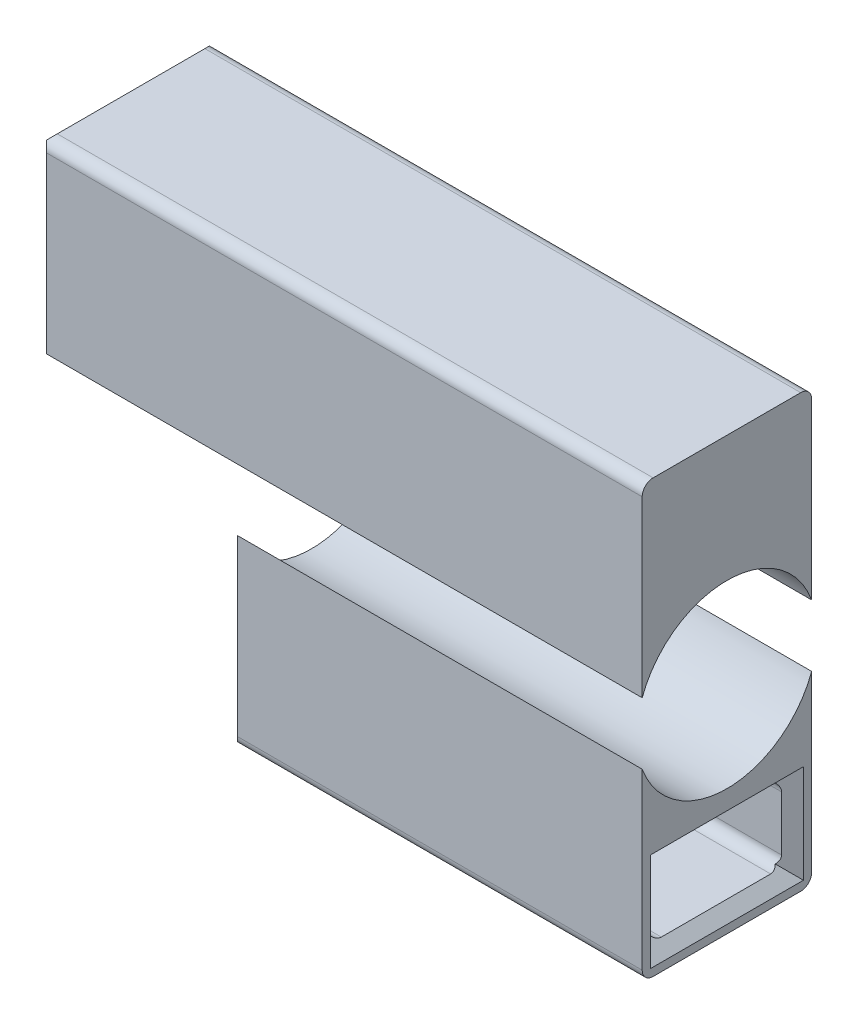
ISO-10303-21;
HEADER;
FILE_DESCRIPTION(('STEP AP214'),'2;1');
FILE_NAME('part.step','',(''),(''),'','','');
FILE_SCHEMA(('AUTOMOTIVE_DESIGN { 1 0 10303 214 1 1 1 1 }'));
ENDSEC;
DATA;
#1=APPLICATION_CONTEXT('core data for automotive mechanical design processes');
#2=APPLICATION_PROTOCOL_DEFINITION('international standard','automotive_design',2000,#1);
#3=PRODUCT_CONTEXT('',#1,'mechanical');
#4=PRODUCT('Part','Part','',(#3));
#5=PRODUCT_RELATED_PRODUCT_CATEGORY('part','',(#4));
#6=PRODUCT_DEFINITION_FORMATION('','',#4);
#7=PRODUCT_DEFINITION_CONTEXT('part definition',#1,'design');
#8=PRODUCT_DEFINITION('design','',#6,#7);
#9=PRODUCT_DEFINITION_SHAPE('','',#8);
#10=(LENGTH_UNIT() NAMED_UNIT(*) SI_UNIT(.MILLI.,.METRE.));
#11=(NAMED_UNIT(*) PLANE_ANGLE_UNIT() SI_UNIT($,.RADIAN.));
#12=(NAMED_UNIT(*) SI_UNIT($,.STERADIAN.) SOLID_ANGLE_UNIT());
#13=UNCERTAINTY_MEASURE_WITH_UNIT(LENGTH_MEASURE(1.E-05),#10,'distance_accuracy_value','');
#14=(GEOMETRIC_REPRESENTATION_CONTEXT(3) GLOBAL_UNCERTAINTY_ASSIGNED_CONTEXT((#13)) GLOBAL_UNIT_ASSIGNED_CONTEXT((#10,
#11,#12)) REPRESENTATION_CONTEXT('',''));
#15=CARTESIAN_POINT('',(0.,0.,0.));
#16=DIRECTION('',(0.,0.,1.));
#17=DIRECTION('',(1.,0.,0.));
#18=AXIS2_PLACEMENT_3D('',#15,#16,#17);
#19=CARTESIAN_POINT('',(0.,11.2892135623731,0.));
#20=DIRECTION('',(1.,0.,0.));
#21=DIRECTION('',(0.,1.,0.));
#22=AXIS2_PLACEMENT_3D('',#19,#20,#21);
#23=PLANE('',#22);
#24=DIRECTION('',(0.,1.,0.));
#25=VECTOR('',#24,1.);
#26=CARTESIAN_POINT('',(0.,7.05882034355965,-6.75));
#27=LINE('',#26,#25);
#28=CARTESIAN_POINT('',(0.,4.74341649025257,-6.75));
#29=VERTEX_POINT('',#28);
#30=CARTESIAN_POINT('',(0.,18.75,-6.75));
#31=VERTEX_POINT('',#30);
#32=EDGE_CURVE('P0_E144',#29,#31,#27,.T.);
#33=ORIENTED_EDGE('',*,*,#32,.F.);
#34=CARTESIAN_POINT('',(0.,0.,0.));
#35=DIRECTION('',(-1.,0.,0.));
#36=DIRECTION('',(0.,-1.,0.));
#37=AXIS2_PLACEMENT_3D('',#34,#35,#36);
#38=CIRCLE('',#37,8.25);
#39=CARTESIAN_POINT('',(0.,4.74341649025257,6.75));
#40=VERTEX_POINT('',#39);
#41=EDGE_CURVE('P0_E11',#40,#29,#38,.T.);
#42=ORIENTED_EDGE('',*,*,#41,.F.);
#43=DIRECTION('',(0.,-1.,0.));
#44=VECTOR('',#43,1.);
#45=CARTESIAN_POINT('',(0.,15.5196067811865,6.75));
#46=LINE('',#45,#44);
#47=CARTESIAN_POINT('',(0.,18.75,6.75));
#48=VERTEX_POINT('',#47);
#49=EDGE_CURVE('P0_E155',#48,#40,#46,.T.);
#50=ORIENTED_EDGE('',*,*,#49,.F.);
#51=DIRECTION('',(0.,0.,1.));
#52=VECTOR('',#51,1.);
#53=CARTESIAN_POINT('',(0.,18.75,-3.875));
#54=LINE('',#53,#52);
#55=EDGE_CURVE('P0_E189',#31,#48,#54,.T.);
#56=ORIENTED_EDGE('',*,*,#55,.F.);
#57=EDGE_LOOP('',(#33,#42,#50,#56));
#58=FACE_BOUND('',#57,.T.);
#59=ADVANCED_FACE('P0_F17',(#58),#23,.F.);
#60=CARTESIAN_POINT('',(55.5,11.2892135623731,0.));
#61=DIRECTION('',(1.,0.,0.));
#62=DIRECTION('',(0.,1.,0.));
#63=AXIS2_PLACEMENT_3D('',#60,#61,#62);
#64=PLANE('',#63);
#65=CARTESIAN_POINT('',(55.5,18.75,6.75));
#66=DIRECTION('',(-1.,0.,0.));
#67=DIRECTION('',(0.,0.707106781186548,0.707106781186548));
#68=AXIS2_PLACEMENT_3D('',#65,#66,#67);
#69=CIRCLE('',#68,1.);
#70=CARTESIAN_POINT('',(55.5,18.75,7.75));
#71=VERTEX_POINT('',#70);
#72=CARTESIAN_POINT('',(55.5,19.75,6.75));
#73=VERTEX_POINT('',#72);
#74=EDGE_CURVE('P0_E172',#71,#73,#69,.T.);
#75=ORIENTED_EDGE('',*,*,#74,.F.);
#76=DIRECTION('',(0.,-1.,0.));
#77=VECTOR('',#76,1.);
#78=CARTESIAN_POINT('',(55.5,19.75,7.75));
#79=LINE('',#78,#77);
#80=CARTESIAN_POINT('',(55.5,2.8284271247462,7.75));
#81=VERTEX_POINT('',#80);
#82=EDGE_CURVE('P0_E160',#71,#81,#79,.T.);
#83=ORIENTED_EDGE('',*,*,#82,.T.);
#84=CARTESIAN_POINT('',(55.5,0.,0.));
#85=DIRECTION('',(-1.,0.,0.));
#86=DIRECTION('',(0.,-1.,0.));
#87=AXIS2_PLACEMENT_3D('',#84,#85,#86);
#88=CIRCLE('',#87,8.25);
#89=CARTESIAN_POINT('',(55.5,2.8284271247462,-7.75));
#90=VERTEX_POINT('',#89);
#91=EDGE_CURVE('P0_E26',#81,#90,#88,.T.);
#92=ORIENTED_EDGE('',*,*,#91,.T.);
#93=DIRECTION('',(0.,1.,0.));
#94=VECTOR('',#93,1.);
#95=CARTESIAN_POINT('',(55.5,-19.75,-7.75));
#96=LINE('',#95,#94);
#97=CARTESIAN_POINT('',(55.5,18.75,-7.75));
#98=VERTEX_POINT('',#97);
#99=EDGE_CURVE('P0_E148',#90,#98,#96,.T.);
#100=ORIENTED_EDGE('',*,*,#99,.T.);
#101=CARTESIAN_POINT('',(55.5,18.75,-6.75));
#102=DIRECTION('',(-1.,0.,0.));
#103=DIRECTION('',(0.,0.707106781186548,-0.707106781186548));
#104=AXIS2_PLACEMENT_3D('',#101,#102,#103);
#105=CIRCLE('',#104,1.);
#106=CARTESIAN_POINT('',(55.5,19.75,-6.75));
#107=VERTEX_POINT('',#106);
#108=EDGE_CURVE('P0_E130',#107,#98,#105,.T.);
#109=ORIENTED_EDGE('',*,*,#108,.F.);
#110=DIRECTION('',(0.,0.,1.));
#111=VECTOR('',#110,1.);
#112=CARTESIAN_POINT('',(55.5,19.75,-7.75));
#113=LINE('',#112,#111);
#114=EDGE_CURVE('P0_E193',#107,#73,#113,.T.);
#115=ORIENTED_EDGE('',*,*,#114,.T.);
#116=EDGE_LOOP('',(#75,#83,#92,#100,#109,#115));
#117=FACE_BOUND('',#116,.T.);
#118=ADVANCED_FACE('P0_F179',(#117),#64,.T.);
#119=CARTESIAN_POINT('',(0.,0.,0.));
#120=DIRECTION('',(1.,0.,0.));
#121=DIRECTION('',(0.,1.,0.));
#122=AXIS2_PLACEMENT_3D('',#119,#120,#121);
#123=CYLINDRICAL_SURFACE('',#122,8.25);
#124=CARTESIAN_POINT('',(-6.75,0.,0.));
#125=DIRECTION('',(0.707106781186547,0.,0.707106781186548));
#126=DIRECTION('',(0.707106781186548,0.,-0.707106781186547));
#127=AXIS2_PLACEMENT_3D('',#124,#125,#126);
#128=ELLIPSE('',#127,11.667261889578,8.25);
#129=CARTESIAN_POINT('',(1.,2.8284271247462,-7.75));
#130=VERTEX_POINT('',#129);
#131=EDGE_CURVE('P0_E116',#130,#29,#128,.T.);
#132=ORIENTED_EDGE('',*,*,#131,.F.);
#133=DIRECTION('',(1.,0.,0.));
#134=VECTOR('',#133,1.);
#135=CARTESIAN_POINT('',(0.,2.8284271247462,-7.75));
#136=LINE('',#135,#134);
#137=EDGE_CURVE('P0_E111',#130,#90,#136,.T.);
#138=ORIENTED_EDGE('',*,*,#137,.T.);
#139=ORIENTED_EDGE('',*,*,#91,.F.);
#140=DIRECTION('',(1.,0.,0.));
#141=VECTOR('',#140,1.);
#142=CARTESIAN_POINT('',(0.,2.8284271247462,7.75));
#143=LINE('',#142,#141);
#144=CARTESIAN_POINT('',(1.,2.8284271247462,7.75));
#145=VERTEX_POINT('',#144);
#146=EDGE_CURVE('P0_E147',#145,#81,#143,.T.);
#147=ORIENTED_EDGE('',*,*,#146,.F.);
#148=CARTESIAN_POINT('',(-6.75,0.,0.));
#149=DIRECTION('',(0.707106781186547,0.,-0.707106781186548));
#150=DIRECTION('',(-0.707106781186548,0.,-0.707106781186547));
#151=AXIS2_PLACEMENT_3D('',#148,#149,#150);
#152=ELLIPSE('',#151,11.667261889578,8.25);
#153=EDGE_CURVE('P0_E159',#40,#145,#152,.T.);
#154=ORIENTED_EDGE('',*,*,#153,.F.);
#155=ORIENTED_EDGE('',*,*,#41,.T.);
#156=EDGE_LOOP('',(#132,#138,#139,#147,#154,#155));
#157=FACE_BOUND('',#156,.T.);
#158=ADVANCED_FACE('P0_F181',(#157),#123,.F.);
#159=CARTESIAN_POINT('',(0.,19.75,7.75));
#160=DIRECTION('',(0.,0.,1.));
#161=DIRECTION('',(0.,-1.,0.));
#162=AXIS2_PLACEMENT_3D('',#159,#160,#161);
#163=PLANE('',#162);
#164=DIRECTION('',(1.,0.,0.));
#165=VECTOR('',#164,1.);
#166=CARTESIAN_POINT('',(0.,18.75,7.75));
#167=LINE('',#166,#165);
#168=CARTESIAN_POINT('',(1.,18.75,7.75));
#169=VERTEX_POINT('',#168);
#170=EDGE_CURVE('P0_E149',#169,#71,#167,.T.);
#171=ORIENTED_EDGE('',*,*,#170,.F.);
#172=DIRECTION('',(0.,1.,0.));
#173=VECTOR('',#172,1.);
#174=CARTESIAN_POINT('',(1.,15.5196067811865,7.75));
#175=LINE('',#174,#173);
#176=EDGE_CURVE('P0_E165',#145,#169,#175,.T.);
#177=ORIENTED_EDGE('',*,*,#176,.F.);
#178=ORIENTED_EDGE('',*,*,#146,.T.);
#179=ORIENTED_EDGE('',*,*,#82,.F.);
#180=EDGE_LOOP('',(#171,#177,#178,#179));
#181=FACE_BOUND('',#180,.T.);
#182=ADVANCED_FACE('P0_F245',(#181),#163,.T.);
#183=CARTESIAN_POINT('',(0.,2.8284271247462,-7.75));
#184=DIRECTION('',(0.,0.,-1.));
#185=DIRECTION('',(-1.,0.,0.));
#186=AXIS2_PLACEMENT_3D('',#183,#184,#185);
#187=PLANE('',#186);
#188=DIRECTION('',(-1.,0.,0.));
#189=VECTOR('',#188,1.);
#190=CARTESIAN_POINT('',(0.,18.75,-7.75));
#191=LINE('',#190,#189);
#192=CARTESIAN_POINT('',(1.,18.75,-7.75));
#193=VERTEX_POINT('',#192);
#194=EDGE_CURVE('P0_E109',#98,#193,#191,.T.);
#195=ORIENTED_EDGE('',*,*,#194,.F.);
#196=ORIENTED_EDGE('',*,*,#99,.F.);
#197=ORIENTED_EDGE('',*,*,#137,.F.);
#198=DIRECTION('',(0.,-1.,0.));
#199=VECTOR('',#198,1.);
#200=CARTESIAN_POINT('',(1.,7.05882034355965,-7.75));
#201=LINE('',#200,#199);
#202=EDGE_CURVE('P0_E104',#193,#130,#201,.T.);
#203=ORIENTED_EDGE('',*,*,#202,.F.);
#204=EDGE_LOOP('',(#195,#196,#197,#203));
#205=FACE_BOUND('',#204,.T.);
#206=ADVANCED_FACE('P0_F106',(#205),#187,.T.);
#207=CARTESIAN_POINT('',(0.5,7.05882034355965,-7.25));
#208=DIRECTION('',(-0.707106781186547,0.,-0.707106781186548));
#209=DIRECTION('',(-0.707106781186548,0.,0.707106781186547));
#210=AXIS2_PLACEMENT_3D('',#207,#208,#209);
#211=PLANE('',#210);
#212=CARTESIAN_POINT('',(0.,18.75,-6.75));
#213=DIRECTION('',(0.707106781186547,0.,0.707106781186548));
#214=DIRECTION('',(0.707106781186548,0.,-0.707106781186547));
#215=AXIS2_PLACEMENT_3D('',#212,#213,#214);
#216=ELLIPSE('',#215,1.4142135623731,1.);
#217=CARTESIAN_POINT('',(0.707106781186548,19.4571067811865,-7.45710678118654));
#218=VERTEX_POINT('',#217);
#219=EDGE_CURVE('P0_E117',#193,#218,#216,.T.);
#220=ORIENTED_EDGE('',*,*,#219,.F.);
#221=ORIENTED_EDGE('',*,*,#202,.T.);
#222=ORIENTED_EDGE('',*,*,#131,.T.);
#223=ORIENTED_EDGE('',*,*,#32,.T.);
#224=DIRECTION('',(0.577350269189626,0.577350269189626,-0.577350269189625));
#225=VECTOR('',#224,1.);
#226=CARTESIAN_POINT('',(-2.09436327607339,16.6556367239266,-4.6556367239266));
#227=LINE('',#226,#225);
#228=EDGE_CURVE('P0_E122',#31,#218,#227,.T.);
#229=ORIENTED_EDGE('',*,*,#228,.T.);
#230=EDGE_LOOP('',(#220,#221,#222,#223,#229));
#231=FACE_BOUND('',#230,.T.);
#232=ADVANCED_FACE('P0_F120',(#231),#211,.T.);
#233=CARTESIAN_POINT('',(0.,18.75,-6.75));
#234=DIRECTION('',(1.,0.,0.));
#235=DIRECTION('',(0.,0.707106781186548,-0.707106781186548));
#236=AXIS2_PLACEMENT_3D('',#233,#234,#235);
#237=CYLINDRICAL_SURFACE('',#236,1.);
#238=ORIENTED_EDGE('',*,*,#108,.T.);
#239=ORIENTED_EDGE('',*,*,#194,.T.);
#240=ORIENTED_EDGE('',*,*,#219,.T.);
#241=CARTESIAN_POINT('',(0.,18.75,-6.75));
#242=DIRECTION('',(0.707106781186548,-0.707106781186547,0.));
#243=DIRECTION('',(0.707106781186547,0.707106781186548,0.));
#244=AXIS2_PLACEMENT_3D('',#241,#242,#243);
#245=ELLIPSE('',#244,1.41421356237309,1.);
#246=CARTESIAN_POINT('',(1.,19.75,-6.75));
#247=VERTEX_POINT('',#246);
#248=EDGE_CURVE('P0_E198',#218,#247,#245,.T.);
#249=ORIENTED_EDGE('',*,*,#248,.T.);
#250=DIRECTION('',(1.,0.,0.));
#251=VECTOR('',#250,1.);
#252=CARTESIAN_POINT('',(0.,19.75,-6.75));
#253=LINE('',#252,#251);
#254=EDGE_CURVE('P0_E137',#247,#107,#253,.T.);
#255=ORIENTED_EDGE('',*,*,#254,.T.);
#256=EDGE_LOOP('',(#238,#239,#240,#249,#255));
#257=FACE_BOUND('',#256,.T.);
#258=ADVANCED_FACE('P0_F128',(#257),#237,.T.);
#259=CARTESIAN_POINT('',(0.,19.75,-7.75));
#260=DIRECTION('',(0.,1.,0.));
#261=DIRECTION('',(0.,0.,-1.));
#262=AXIS2_PLACEMENT_3D('',#259,#260,#261);
#263=PLANE('',#262);
#264=DIRECTION('',(-1.,0.,0.));
#265=VECTOR('',#264,1.);
#266=CARTESIAN_POINT('',(0.,19.75,6.75));
#267=LINE('',#266,#265);
#268=CARTESIAN_POINT('',(1.,19.75,6.75));
#269=VERTEX_POINT('',#268);
#270=EDGE_CURVE('P0_E167',#73,#269,#267,.T.);
#271=ORIENTED_EDGE('',*,*,#270,.F.);
#272=ORIENTED_EDGE('',*,*,#114,.F.);
#273=ORIENTED_EDGE('',*,*,#254,.F.);
#274=DIRECTION('',(0.,0.,-1.));
#275=VECTOR('',#274,1.);
#276=CARTESIAN_POINT('',(1.,19.75,-3.875));
#277=LINE('',#276,#275);
#278=EDGE_CURVE('P0_E204',#269,#247,#277,.T.);
#279=ORIENTED_EDGE('',*,*,#278,.F.);
#280=EDGE_LOOP('',(#271,#272,#273,#279));
#281=FACE_BOUND('',#280,.T.);
#282=ADVANCED_FACE('P0_F227',(#281),#263,.T.);
#283=CARTESIAN_POINT('',(0.5,19.25,-3.875));
#284=DIRECTION('',(-0.707106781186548,0.707106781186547,0.));
#285=DIRECTION('',(0.,0.,1.));
#286=AXIS2_PLACEMENT_3D('',#283,#284,#285);
#287=PLANE('',#286);
#288=CARTESIAN_POINT('',(0.,18.75,6.75));
#289=DIRECTION('',(0.707106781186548,-0.707106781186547,0.));
#290=DIRECTION('',(0.707106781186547,0.707106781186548,0.));
#291=AXIS2_PLACEMENT_3D('',#288,#289,#290);
#292=ELLIPSE('',#291,1.41421356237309,1.);
#293=CARTESIAN_POINT('',(0.707106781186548,19.4571067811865,7.45710678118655));
#294=VERTEX_POINT('',#293);
#295=EDGE_CURVE('P0_E171',#269,#294,#292,.T.);
#296=ORIENTED_EDGE('',*,*,#295,.F.);
#297=ORIENTED_EDGE('',*,*,#278,.T.);
#298=ORIENTED_EDGE('',*,*,#248,.F.);
#299=ORIENTED_EDGE('',*,*,#228,.F.);
#300=ORIENTED_EDGE('',*,*,#55,.T.);
#301=DIRECTION('',(-0.577350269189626,-0.577350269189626,-0.577350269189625));
#302=VECTOR('',#301,1.);
#303=CARTESIAN_POINT('',(-1.97589886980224,16.7741011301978,4.77410113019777));
#304=LINE('',#303,#302);
#305=EDGE_CURVE('P0_E153',#294,#48,#304,.T.);
#306=ORIENTED_EDGE('',*,*,#305,.F.);
#307=EDGE_LOOP('',(#296,#297,#298,#299,#300,#306));
#308=FACE_BOUND('',#307,.T.);
#309=ADVANCED_FACE('P0_F196',(#308),#287,.T.);
#310=CARTESIAN_POINT('',(0.5,15.5196067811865,7.25));
#311=DIRECTION('',(-0.707106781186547,0.,0.707106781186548));
#312=DIRECTION('',(0.,1.,0.));
#313=AXIS2_PLACEMENT_3D('',#310,#311,#312);
#314=PLANE('',#313);
#315=CARTESIAN_POINT('',(0.,18.75,6.75));
#316=DIRECTION('',(0.707106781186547,0.,-0.707106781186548));
#317=DIRECTION('',(0.707106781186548,0.,0.707106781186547));
#318=AXIS2_PLACEMENT_3D('',#315,#316,#317);
#319=ELLIPSE('',#318,1.4142135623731,1.);
#320=EDGE_CURVE('P0_E154',#294,#169,#319,.T.);
#321=ORIENTED_EDGE('',*,*,#320,.F.);
#322=ORIENTED_EDGE('',*,*,#305,.T.);
#323=ORIENTED_EDGE('',*,*,#49,.T.);
#324=ORIENTED_EDGE('',*,*,#153,.T.);
#325=ORIENTED_EDGE('',*,*,#176,.T.);
#326=EDGE_LOOP('',(#321,#322,#323,#324,#325));
#327=FACE_BOUND('',#326,.T.);
#328=ADVANCED_FACE('P0_F242',(#327),#314,.T.);
#329=CARTESIAN_POINT('',(0.,18.75,6.75));
#330=DIRECTION('',(1.,0.,0.));
#331=DIRECTION('',(0.,0.707106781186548,0.707106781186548));
#332=AXIS2_PLACEMENT_3D('',#329,#330,#331);
#333=CYLINDRICAL_SURFACE('',#332,1.);
#334=ORIENTED_EDGE('',*,*,#74,.T.);
#335=ORIENTED_EDGE('',*,*,#270,.T.);
#336=ORIENTED_EDGE('',*,*,#295,.T.);
#337=ORIENTED_EDGE('',*,*,#320,.T.);
#338=ORIENTED_EDGE('',*,*,#170,.T.);
#339=EDGE_LOOP('',(#334,#335,#336,#337,#338));
#340=FACE_BOUND('',#339,.T.);
#341=ADVANCED_FACE('P0_F231',(#340),#333,.T.);
#342=CLOSED_SHELL('',(#59,#118,#158,#182,#206,#232,#258,#282,#309,#328,#341));
#343=MANIFOLD_SOLID_BREP('P0_B1',#342);
#344=CARTESIAN_POINT('',(0.,0.,0.));
#345=DIRECTION('',(1.,0.,0.));
#346=DIRECTION('',(0.,-1.,0.));
#347=AXIS2_PLACEMENT_3D('',#344,#345,#346);
#348=CYLINDRICAL_SURFACE('',#347,8.25);
#349=CARTESIAN_POINT('',(10.75,0.,0.));
#350=DIRECTION('',(0.707106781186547,0.,0.707106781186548));
#351=DIRECTION('',(0.707106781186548,0.,-0.707106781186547));
#352=AXIS2_PLACEMENT_3D('',#349,#350,#351);
#353=ELLIPSE('',#352,11.667261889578,8.25);
#354=CARTESIAN_POINT('',(17.5,-4.74341649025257,-6.75));
#355=VERTEX_POINT('',#354);
#356=CARTESIAN_POINT('',(18.5,-2.8284271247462,-7.75));
#357=VERTEX_POINT('',#356);
#358=EDGE_CURVE('P1_E296',#355,#357,#353,.T.);
#359=ORIENTED_EDGE('',*,*,#358,.F.);
#360=CARTESIAN_POINT('',(17.5,0.,0.));
#361=DIRECTION('',(-1.,0.,0.));
#362=DIRECTION('',(0.,-1.,0.));
#363=AXIS2_PLACEMENT_3D('',#360,#361,#362);
#364=CIRCLE('',#363,8.25);
#365=CARTESIAN_POINT('',(17.5,-4.74341649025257,6.75));
#366=VERTEX_POINT('',#365);
#367=EDGE_CURVE('P1_E284',#355,#366,#364,.T.);
#368=ORIENTED_EDGE('',*,*,#367,.T.);
#369=CARTESIAN_POINT('',(10.75,0.,0.));
#370=DIRECTION('',(0.707106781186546,0.,-0.707106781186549));
#371=DIRECTION('',(-0.707106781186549,0.,-0.707106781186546));
#372=AXIS2_PLACEMENT_3D('',#369,#370,#371);
#373=ELLIPSE('',#372,11.6672618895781,8.25);
#374=CARTESIAN_POINT('',(18.5,-2.82842712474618,7.75));
#375=VERTEX_POINT('',#374);
#376=EDGE_CURVE('P1_E319',#375,#366,#373,.T.);
#377=ORIENTED_EDGE('',*,*,#376,.F.);
#378=DIRECTION('',(1.,0.,0.));
#379=VECTOR('',#378,1.);
#380=CARTESIAN_POINT('',(0.,-2.82842712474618,7.75));
#381=LINE('',#380,#379);
#382=CARTESIAN_POINT('',(55.5,-2.82842712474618,7.75));
#383=VERTEX_POINT('',#382);
#384=EDGE_CURVE('P1_E27',#375,#383,#381,.T.);
#385=ORIENTED_EDGE('',*,*,#384,.T.);
#386=CARTESIAN_POINT('',(55.5,0.,0.));
#387=DIRECTION('',(-1.,0.,0.));
#388=DIRECTION('',(0.,-1.,0.));
#389=AXIS2_PLACEMENT_3D('',#386,#387,#388);
#390=CIRCLE('',#389,8.25);
#391=CARTESIAN_POINT('',(55.5,-2.8284271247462,-7.75));
#392=VERTEX_POINT('',#391);
#393=EDGE_CURVE('P1_E253',#392,#383,#390,.T.);
#394=ORIENTED_EDGE('',*,*,#393,.F.);
#395=DIRECTION('',(1.,0.,0.));
#396=VECTOR('',#395,1.);
#397=CARTESIAN_POINT('',(0.,-2.8284271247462,-7.75));
#398=LINE('',#397,#396);
#399=EDGE_CURVE('P1_E10',#357,#392,#398,.T.);
#400=ORIENTED_EDGE('',*,*,#399,.F.);
#401=EDGE_LOOP('',(#359,#368,#377,#385,#394,#400));
#402=FACE_BOUND('',#401,.T.);
#403=ADVANCED_FACE('P1_F16',(#402),#348,.F.);
#404=CARTESIAN_POINT('',(0.,-19.75,-7.75));
#405=DIRECTION('',(0.,0.,-1.));
#406=DIRECTION('',(-1.,0.,0.));
#407=AXIS2_PLACEMENT_3D('',#404,#405,#406);
#408=PLANE('',#407);
#409=DIRECTION('',(1.,0.,0.));
#410=VECTOR('',#409,1.);
#411=CARTESIAN_POINT('',(0.,-18.75,-7.75));
#412=LINE('',#411,#410);
#413=CARTESIAN_POINT('',(18.5,-18.75,-7.75));
#414=VERTEX_POINT('',#413);
#415=CARTESIAN_POINT('',(55.5,-18.75,-7.75));
#416=VERTEX_POINT('',#415);
#417=EDGE_CURVE('P1_E232',#414,#416,#412,.T.);
#418=ORIENTED_EDGE('',*,*,#417,.F.);
#419=DIRECTION('',(0.,-1.,0.));
#420=VECTOR('',#419,1.);
#421=CARTESIAN_POINT('',(18.5,-16.9157678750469,-7.75));
#422=LINE('',#421,#420);
#423=EDGE_CURVE('P1_E227',#357,#414,#422,.T.);
#424=ORIENTED_EDGE('',*,*,#423,.F.);
#425=ORIENTED_EDGE('',*,*,#399,.T.);
#426=DIRECTION('',(0.,1.,0.));
#427=VECTOR('',#426,1.);
#428=CARTESIAN_POINT('',(55.5,-19.75,-7.75));
#429=LINE('',#428,#427);
#430=EDGE_CURVE('P1_E249',#416,#392,#429,.T.);
#431=ORIENTED_EDGE('',*,*,#430,.F.);
#432=EDGE_LOOP('',(#418,#424,#425,#431));
#433=FACE_BOUND('',#432,.T.);
#434=ADVANCED_FACE('P1_F503',(#433),#408,.T.);
#435=CARTESIAN_POINT('',(0.,-2.82842712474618,7.75));
#436=DIRECTION('',(0.,0.,1.));
#437=DIRECTION('',(0.,-1.,0.));
#438=AXIS2_PLACEMENT_3D('',#435,#436,#437);
#439=PLANE('',#438);
#440=DIRECTION('',(-1.,0.,0.));
#441=VECTOR('',#440,1.);
#442=CARTESIAN_POINT('',(0.,-18.75,7.75));
#443=LINE('',#442,#441);
#444=CARTESIAN_POINT('',(55.5,-18.75,7.75));
#445=VERTEX_POINT('',#444);
#446=CARTESIAN_POINT('',(18.5,-18.75,7.75));
#447=VERTEX_POINT('',#446);
#448=EDGE_CURVE('P1_E349',#445,#447,#443,.T.);
#449=ORIENTED_EDGE('',*,*,#448,.F.);
#450=DIRECTION('',(0.,-1.,0.));
#451=VECTOR('',#450,1.);
#452=CARTESIAN_POINT('',(55.5,19.75,7.75));
#453=LINE('',#452,#451);
#454=EDGE_CURVE('P1_E301',#383,#445,#453,.T.);
#455=ORIENTED_EDGE('',*,*,#454,.F.);
#456=ORIENTED_EDGE('',*,*,#384,.F.);
#457=DIRECTION('',(0.,1.,0.));
#458=VECTOR('',#457,1.);
#459=CARTESIAN_POINT('',(18.5,-8.45498143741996,7.75));
#460=LINE('',#459,#458);
#461=EDGE_CURVE('P1_E355',#447,#375,#460,.T.);
#462=ORIENTED_EDGE('',*,*,#461,.F.);
#463=EDGE_LOOP('',(#449,#455,#456,#462));
#464=FACE_BOUND('',#463,.T.);
#465=ADVANCED_FACE('P1_F509',(#464),#439,.T.);
#466=CARTESIAN_POINT('',(18.,-8.45498143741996,7.25));
#467=DIRECTION('',(-0.707106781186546,0.,0.707106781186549));
#468=DIRECTION('',(0.,1.,0.));
#469=AXIS2_PLACEMENT_3D('',#466,#467,#468);
#470=PLANE('',#469);
#471=CARTESIAN_POINT('',(17.5,-18.75,6.75));
#472=DIRECTION('',(0.707106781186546,0.,-0.707106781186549));
#473=DIRECTION('',(0.707106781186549,0.,0.707106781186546));
#474=AXIS2_PLACEMENT_3D('',#471,#472,#473);
#475=ELLIPSE('',#474,1.4142135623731,1.);
#476=CARTESIAN_POINT('',(18.2071067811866,-19.4571067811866,7.45710678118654));
#477=VERTEX_POINT('',#476);
#478=EDGE_CURVE('P1_E353',#447,#477,#475,.T.);
#479=ORIENTED_EDGE('',*,*,#478,.F.);
#480=ORIENTED_EDGE('',*,*,#461,.T.);
#481=ORIENTED_EDGE('',*,*,#376,.T.);
#482=DIRECTION('',(0.,-1.,0.));
#483=VECTOR('',#482,1.);
#484=CARTESIAN_POINT('',(17.5,-8.45498143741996,6.75));
#485=LINE('',#484,#483);
#486=CARTESIAN_POINT('',(17.5,-18.75,6.75));
#487=VERTEX_POINT('',#486);
#488=EDGE_CURVE('P1_E280',#366,#487,#485,.T.);
#489=ORIENTED_EDGE('',*,*,#488,.T.);
#490=DIRECTION('',(0.577350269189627,-0.577350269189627,0.577350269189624));
#491=VECTOR('',#490,1.);
#492=CARTESIAN_POINT('',(15.63833023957,-16.88833023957,4.88833023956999));
#493=LINE('',#492,#491);
#494=EDGE_CURVE('P1_E266',#487,#477,#493,.T.);
#495=ORIENTED_EDGE('',*,*,#494,.T.);
#496=EDGE_LOOP('',(#479,#480,#481,#489,#495));
#497=FACE_BOUND('',#496,.T.);
#498=ADVANCED_FACE('P1_F533',(#497),#470,.T.);
#499=CARTESIAN_POINT('',(17.5,-14.0815357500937,0.));
#500=DIRECTION('',(1.,0.,0.));
#501=DIRECTION('',(0.,1.,0.));
#502=AXIS2_PLACEMENT_3D('',#499,#500,#501);
#503=PLANE('',#502);
#504=DIRECTION('',(0.,1.,0.));
#505=VECTOR('',#504,1.);
#506=CARTESIAN_POINT('',(17.5,-12.5407678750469,-6.));
#507=LINE('',#506,#505);
#508=CARTESIAN_POINT('',(17.5,-17.,-6.));
#509=VERTEX_POINT('',#508);
#510=CARTESIAN_POINT('',(17.5,-12.,-6.));
#511=VERTEX_POINT('',#510);
#512=EDGE_CURVE('P1_E376',#509,#511,#507,.T.);
#513=ORIENTED_EDGE('',*,*,#512,.T.);
#514=CARTESIAN_POINT('',(17.5,-12.,-5.));
#515=DIRECTION('',(-1.,0.,0.));
#516=DIRECTION('',(0.,0.707106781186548,-0.707106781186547));
#517=AXIS2_PLACEMENT_3D('',#514,#515,#516);
#518=CIRCLE('',#517,1.);
#519=CARTESIAN_POINT('',(17.5,-11.,-5.));
#520=VERTEX_POINT('',#519);
#521=EDGE_CURVE('P1_E264',#520,#511,#518,.T.);
#522=ORIENTED_EDGE('',*,*,#521,.F.);
#523=DIRECTION('',(0.,0.,1.));
#524=VECTOR('',#523,1.);
#525=CARTESIAN_POINT('',(17.5,-11.,3.));
#526=LINE('',#525,#524);
#527=CARTESIAN_POINT('',(17.5,-11.,5.));
#528=VERTEX_POINT('',#527);
#529=EDGE_CURVE('P1_E134',#520,#528,#526,.T.);
#530=ORIENTED_EDGE('',*,*,#529,.T.);
#531=CARTESIAN_POINT('',(17.5,-12.,5.));
#532=DIRECTION('',(-1.,0.,0.));
#533=DIRECTION('',(0.,0.707106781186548,0.707106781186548));
#534=AXIS2_PLACEMENT_3D('',#531,#532,#533);
#535=CIRCLE('',#534,1.);
#536=CARTESIAN_POINT('',(17.5,-12.,6.));
#537=VERTEX_POINT('',#536);
#538=EDGE_CURVE('P1_E314',#537,#528,#535,.T.);
#539=ORIENTED_EDGE('',*,*,#538,.F.);
#540=DIRECTION('',(0.,-1.,0.));
#541=VECTOR('',#540,1.);
#542=CARTESIAN_POINT('',(17.5,-16.0407678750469,6.));
#543=LINE('',#542,#541);
#544=CARTESIAN_POINT('',(17.5,-17.,6.));
#545=VERTEX_POINT('',#544);
#546=EDGE_CURVE('P1_E313',#537,#545,#543,.T.);
#547=ORIENTED_EDGE('',*,*,#546,.T.);
#548=CARTESIAN_POINT('',(17.5,-17.,5.));
#549=DIRECTION('',(-1.,0.,0.));
#550=DIRECTION('',(0.,-0.707106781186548,0.707106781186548));
#551=AXIS2_PLACEMENT_3D('',#548,#549,#550);
#552=CIRCLE('',#551,1.);
#553=CARTESIAN_POINT('',(17.5,-18.,5.));
#554=VERTEX_POINT('',#553);
#555=EDGE_CURVE('P1_E385',#554,#545,#552,.T.);
#556=ORIENTED_EDGE('',*,*,#555,.F.);
#557=DIRECTION('',(0.,0.,-1.));
#558=VECTOR('',#557,1.);
#559=CARTESIAN_POINT('',(17.5,-18.,-3.));
#560=LINE('',#559,#558);
#561=CARTESIAN_POINT('',(17.5,-18.,-5.));
#562=VERTEX_POINT('',#561);
#563=EDGE_CURVE('P1_E395',#554,#562,#560,.T.);
#564=ORIENTED_EDGE('',*,*,#563,.T.);
#565=CARTESIAN_POINT('',(17.5,-17.,-5.));
#566=DIRECTION('',(-1.,0.,0.));
#567=DIRECTION('',(0.,-0.70710678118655,-0.707106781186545));
#568=AXIS2_PLACEMENT_3D('',#565,#566,#567);
#569=CIRCLE('',#568,1.);
#570=EDGE_CURVE('P1_E361',#509,#562,#569,.T.);
#571=ORIENTED_EDGE('',*,*,#570,.F.);
#572=EDGE_LOOP('',(#513,#522,#530,#539,#547,#556,#564,#571));
#573=FACE_BOUND('',#572,.T.);
#574=DIRECTION('',(0.,1.,0.));
#575=VECTOR('',#574,1.);
#576=CARTESIAN_POINT('',(17.5,-16.9157678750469,-6.75));
#577=LINE('',#576,#575);
#578=CARTESIAN_POINT('',(17.5,-18.75,-6.75));
#579=VERTEX_POINT('',#578);
#580=EDGE_CURVE('P1_E293',#579,#355,#577,.T.);
#581=ORIENTED_EDGE('',*,*,#580,.F.);
#582=DIRECTION('',(0.,0.,-1.));
#583=VECTOR('',#582,1.);
#584=CARTESIAN_POINT('',(17.5,-18.75,3.875));
#585=LINE('',#584,#583);
#586=EDGE_CURVE('P1_E217',#487,#579,#585,.T.);
#587=ORIENTED_EDGE('',*,*,#586,.F.);
#588=ORIENTED_EDGE('',*,*,#488,.F.);
#589=ORIENTED_EDGE('',*,*,#367,.F.);
#590=EDGE_LOOP('',(#581,#587,#588,#589));
#591=FACE_BOUND('',#590,.T.);
#592=ADVANCED_FACE('P1_F485',(#573,#591),#503,.F.);
#593=CARTESIAN_POINT('',(18.,-16.9157678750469,-7.25));
#594=DIRECTION('',(-0.707106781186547,0.,-0.707106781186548));
#595=DIRECTION('',(-0.707106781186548,0.,0.707106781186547));
#596=AXIS2_PLACEMENT_3D('',#593,#594,#595);
#597=PLANE('',#596);
#598=CARTESIAN_POINT('',(17.5,-18.75,-6.75));
#599=DIRECTION('',(0.707106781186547,0.,0.707106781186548));
#600=DIRECTION('',(0.707106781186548,0.,-0.707106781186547));
#601=AXIS2_PLACEMENT_3D('',#598,#599,#600);
#602=ELLIPSE('',#601,1.4142135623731,1.);
#603=CARTESIAN_POINT('',(18.2071067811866,-19.4571067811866,-7.45710678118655));
#604=VERTEX_POINT('',#603);
#605=EDGE_CURVE('P1_E224',#604,#414,#602,.T.);
#606=ORIENTED_EDGE('',*,*,#605,.F.);
#607=DIRECTION('',(-0.577350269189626,0.577350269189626,0.577350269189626));
#608=VECTOR('',#607,1.);
#609=CARTESIAN_POINT('',(15.7567946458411,-17.0067946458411,-5.00679464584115));
#610=LINE('',#609,#608);
#611=EDGE_CURVE('P1_E208',#604,#579,#610,.T.);
#612=ORIENTED_EDGE('',*,*,#611,.T.);
#613=ORIENTED_EDGE('',*,*,#580,.T.);
#614=ORIENTED_EDGE('',*,*,#358,.T.);
#615=ORIENTED_EDGE('',*,*,#423,.T.);
#616=EDGE_LOOP('',(#606,#612,#613,#614,#615));
#617=FACE_BOUND('',#616,.T.);
#618=ADVANCED_FACE('P1_F18',(#617),#597,.T.);
#619=CARTESIAN_POINT('',(55.,-18.5,-3.));
#620=DIRECTION('',(0.707106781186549,0.707106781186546,0.));
#621=DIRECTION('',(0.,0.,-1.));
#622=AXIS2_PLACEMENT_3D('',#619,#620,#621);
#623=PLANE('',#622);
#624=DIRECTION('',(0.,0.,-1.));
#625=VECTOR('',#624,1.);
#626=CARTESIAN_POINT('',(55.5,-19.,-3.));
#627=LINE('',#626,#625);
#628=CARTESIAN_POINT('',(55.5,-19.,7.));
#629=VERTEX_POINT('',#628);
#630=CARTESIAN_POINT('',(55.5,-19.,-7.));
#631=VERTEX_POINT('',#630);
#632=EDGE_CURVE('P1_E258',#629,#631,#627,.T.);
#633=ORIENTED_EDGE('',*,*,#632,.T.);
#634=DIRECTION('',(0.577350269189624,-0.577350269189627,-0.577350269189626));
#635=VECTOR('',#634,1.);
#636=CARTESIAN_POINT('',(53.1907677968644,-16.6907677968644,-4.69076779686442));
#637=LINE('',#636,#635);
#638=CARTESIAN_POINT('',(54.2071067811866,-17.7071067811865,-5.70710678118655));
#639=VERTEX_POINT('',#638);
#640=EDGE_CURVE('P1_E324',#639,#631,#637,.T.);
#641=ORIENTED_EDGE('',*,*,#640,.F.);
#642=CARTESIAN_POINT('',(53.5,-17.,-5.));
#643=DIRECTION('',(-0.707106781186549,-0.707106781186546,0.));
#644=DIRECTION('',(0.707106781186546,-0.707106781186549,0.));
#645=AXIS2_PLACEMENT_3D('',#642,#643,#644);
#646=ELLIPSE('',#645,1.41421356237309,1.);
#647=CARTESIAN_POINT('',(54.5,-18.,-5.));
#648=VERTEX_POINT('',#647);
#649=EDGE_CURVE('P1_E396',#639,#648,#646,.T.);
#650=ORIENTED_EDGE('',*,*,#649,.T.);
#651=DIRECTION('',(0.,0.,1.));
#652=VECTOR('',#651,1.);
#653=CARTESIAN_POINT('',(54.5,-18.,-3.));
#654=LINE('',#653,#652);
#655=CARTESIAN_POINT('',(54.5,-18.,5.));
#656=VERTEX_POINT('',#655);
#657=EDGE_CURVE('P1_E279',#648,#656,#654,.T.);
#658=ORIENTED_EDGE('',*,*,#657,.T.);
#659=CARTESIAN_POINT('',(53.5,-17.,5.));
#660=DIRECTION('',(-0.707106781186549,-0.707106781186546,0.));
#661=DIRECTION('',(0.707106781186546,-0.707106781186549,0.));
#662=AXIS2_PLACEMENT_3D('',#659,#660,#661);
#663=ELLIPSE('',#662,1.41421356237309,1.);
#664=CARTESIAN_POINT('',(54.2071067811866,-17.7071067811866,5.70710678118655));
#665=VERTEX_POINT('',#664);
#666=EDGE_CURVE('P1_E423',#656,#665,#663,.T.);
#667=ORIENTED_EDGE('',*,*,#666,.T.);
#668=DIRECTION('',(0.577350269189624,-0.577350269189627,0.577350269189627));
#669=VECTOR('',#668,1.);
#670=CARTESIAN_POINT('',(52.7741011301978,-16.2741011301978,4.27410113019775));
#671=LINE('',#670,#669);
#672=EDGE_CURVE('P1_E297',#665,#629,#671,.T.);
#673=ORIENTED_EDGE('',*,*,#672,.T.);
#674=EDGE_LOOP('',(#633,#641,#650,#658,#667,#673));
#675=FACE_BOUND('',#674,.T.);
#676=ADVANCED_FACE('P1_F463',(#675),#623,.T.);
#677=CARTESIAN_POINT('',(55.,-14.6446067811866,6.5));
#678=DIRECTION('',(0.707106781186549,0.,-0.707106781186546));
#679=DIRECTION('',(0.,-1.,0.));
#680=AXIS2_PLACEMENT_3D('',#677,#678,#679);
#681=PLANE('',#680);
#682=DIRECTION('',(0.,1.,0.));
#683=VECTOR('',#682,1.);
#684=CARTESIAN_POINT('',(54.5,-14.6446067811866,6.));
#685=LINE('',#684,#683);
#686=CARTESIAN_POINT('',(54.5,-17.,6.));
#687=VERTEX_POINT('',#686);
#688=CARTESIAN_POINT('',(54.5,-12.,6.));
#689=VERTEX_POINT('',#688);
#690=EDGE_CURVE('P1_E339',#687,#689,#685,.T.);
#691=ORIENTED_EDGE('',*,*,#690,.T.);
#692=CARTESIAN_POINT('',(53.5,-12.,5.));
#693=DIRECTION('',(-0.707106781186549,0.,0.707106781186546));
#694=DIRECTION('',(0.707106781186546,0.,0.707106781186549));
#695=AXIS2_PLACEMENT_3D('',#692,#693,#694);
#696=ELLIPSE('',#695,1.41421356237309,1.);
#697=CARTESIAN_POINT('',(54.2071067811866,-11.2928932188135,5.70710678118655));
#698=VERTEX_POINT('',#697);
#699=EDGE_CURVE('P1_E274',#689,#698,#696,.T.);
#700=ORIENTED_EDGE('',*,*,#699,.T.);
#701=DIRECTION('',(0.577350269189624,0.577350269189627,0.577350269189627));
#702=VECTOR('',#701,1.);
#703=CARTESIAN_POINT('',(53.7258988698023,-11.7741011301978,5.22589886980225));
#704=LINE('',#703,#702);
#705=CARTESIAN_POINT('',(55.5,-10.,7.));
#706=VERTEX_POINT('',#705);
#707=EDGE_CURVE('P1_E322',#698,#706,#704,.T.);
#708=ORIENTED_EDGE('',*,*,#707,.T.);
#709=DIRECTION('',(0.,-1.,0.));
#710=VECTOR('',#709,1.);
#711=CARTESIAN_POINT('',(55.5,-14.6446067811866,7.));
#712=LINE('',#711,#710);
#713=EDGE_CURVE('P1_E346',#706,#629,#712,.T.);
#714=ORIENTED_EDGE('',*,*,#713,.T.);
#715=ORIENTED_EDGE('',*,*,#672,.F.);
#716=CARTESIAN_POINT('',(53.5,-17.,5.));
#717=DIRECTION('',(-0.707106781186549,0.,0.707106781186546));
#718=DIRECTION('',(0.707106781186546,0.,0.707106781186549));
#719=AXIS2_PLACEMENT_3D('',#716,#717,#718);
#720=ELLIPSE('',#719,1.41421356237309,1.);
#721=EDGE_CURVE('P1_E20',#665,#687,#720,.T.);
#722=ORIENTED_EDGE('',*,*,#721,.T.);
#723=EDGE_LOOP('',(#691,#700,#708,#714,#715,#722));
#724=FACE_BOUND('',#723,.T.);
#725=ADVANCED_FACE('P1_F475',(#724),#681,.T.);
#726=CARTESIAN_POINT('',(55.,-10.5,3.));
#727=DIRECTION('',(0.707106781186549,-0.707106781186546,0.));
#728=DIRECTION('',(0.,0.,-1.));
#729=AXIS2_PLACEMENT_3D('',#726,#727,#728);
#730=PLANE('',#729);
#731=DIRECTION('',(0.,0.,1.));
#732=VECTOR('',#731,1.);
#733=CARTESIAN_POINT('',(55.5,-10.,3.));
#734=LINE('',#733,#732);
#735=CARTESIAN_POINT('',(55.5,-10.,-7.));
#736=VERTEX_POINT('',#735);
#737=EDGE_CURVE('P1_E354',#736,#706,#734,.T.);
#738=ORIENTED_EDGE('',*,*,#737,.T.);
#739=ORIENTED_EDGE('',*,*,#707,.F.);
#740=CARTESIAN_POINT('',(53.5,-12.,5.));
#741=DIRECTION('',(-0.707106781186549,0.707106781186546,0.));
#742=DIRECTION('',(0.707106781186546,0.707106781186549,0.));
#743=AXIS2_PLACEMENT_3D('',#740,#741,#742);
#744=ELLIPSE('',#743,1.41421356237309,1.);
#745=CARTESIAN_POINT('',(54.5,-11.,5.));
#746=VERTEX_POINT('',#745);
#747=EDGE_CURVE('P1_E310',#698,#746,#744,.T.);
#748=ORIENTED_EDGE('',*,*,#747,.T.);
#749=DIRECTION('',(0.,0.,-1.));
#750=VECTOR('',#749,1.);
#751=CARTESIAN_POINT('',(54.5,-11.,3.));
#752=LINE('',#751,#750);
#753=CARTESIAN_POINT('',(54.5,-11.,-5.));
#754=VERTEX_POINT('',#753);
#755=EDGE_CURVE('P1_E288',#746,#754,#752,.T.);
#756=ORIENTED_EDGE('',*,*,#755,.T.);
#757=CARTESIAN_POINT('',(53.5,-12.,-5.));
#758=DIRECTION('',(-0.707106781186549,0.707106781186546,0.));
#759=DIRECTION('',(0.707106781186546,0.707106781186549,0.));
#760=AXIS2_PLACEMENT_3D('',#757,#758,#759);
#761=ELLIPSE('',#760,1.41421356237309,1.);
#762=CARTESIAN_POINT('',(54.2071067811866,-11.2928932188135,-5.70710678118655));
#763=VERTEX_POINT('',#762);
#764=EDGE_CURVE('P1_E265',#754,#763,#761,.T.);
#765=ORIENTED_EDGE('',*,*,#764,.T.);
#766=DIRECTION('',(0.577350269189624,0.577350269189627,-0.577350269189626));
#767=VECTOR('',#766,1.);
#768=CARTESIAN_POINT('',(53.3092322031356,-12.1907677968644,-4.80923220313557));
#769=LINE('',#768,#767);
#770=EDGE_CURVE('P1_E146',#763,#736,#769,.T.);
#771=ORIENTED_EDGE('',*,*,#770,.T.);
#772=EDGE_LOOP('',(#738,#739,#748,#756,#765,#771));
#773=FACE_BOUND('',#772,.T.);
#774=ADVANCED_FACE('P1_F445',(#773),#730,.T.);
#775=CARTESIAN_POINT('',(55.,-11.1446067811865,-6.5));
#776=DIRECTION('',(0.707106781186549,0.,0.707106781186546));
#777=DIRECTION('',(0.,-1.,0.));
#778=AXIS2_PLACEMENT_3D('',#775,#776,#777);
#779=PLANE('',#778);
#780=DIRECTION('',(0.,1.,0.));
#781=VECTOR('',#780,1.);
#782=CARTESIAN_POINT('',(55.5,-11.1446067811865,-7.));
#783=LINE('',#782,#781);
#784=EDGE_CURVE('P1_E255',#631,#736,#783,.T.);
#785=ORIENTED_EDGE('',*,*,#784,.T.);
#786=ORIENTED_EDGE('',*,*,#770,.F.);
#787=CARTESIAN_POINT('',(53.5,-12.,-5.));
#788=DIRECTION('',(-0.707106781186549,0.,-0.707106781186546));
#789=DIRECTION('',(0.707106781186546,0.,-0.707106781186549));
#790=AXIS2_PLACEMENT_3D('',#787,#788,#789);
#791=ELLIPSE('',#790,1.41421356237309,1.);
#792=CARTESIAN_POINT('',(54.5,-12.,-6.));
#793=VERTEX_POINT('',#792);
#794=EDGE_CURVE('P1_E290',#763,#793,#791,.T.);
#795=ORIENTED_EDGE('',*,*,#794,.T.);
#796=DIRECTION('',(0.,-1.,0.));
#797=VECTOR('',#796,1.);
#798=CARTESIAN_POINT('',(54.5,-11.1446067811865,-6.));
#799=LINE('',#798,#797);
#800=CARTESIAN_POINT('',(54.5,-17.,-6.));
#801=VERTEX_POINT('',#800);
#802=EDGE_CURVE('P1_E377',#793,#801,#799,.T.);
#803=ORIENTED_EDGE('',*,*,#802,.T.);
#804=CARTESIAN_POINT('',(53.5,-17.,-5.));
#805=DIRECTION('',(-0.707106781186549,0.,-0.707106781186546));
#806=DIRECTION('',(0.707106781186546,0.,-0.707106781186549));
#807=AXIS2_PLACEMENT_3D('',#804,#805,#806);
#808=ELLIPSE('',#807,1.41421356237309,1.);
#809=EDGE_CURVE('P1_E402',#801,#639,#808,.T.);
#810=ORIENTED_EDGE('',*,*,#809,.T.);
#811=ORIENTED_EDGE('',*,*,#640,.T.);
#812=EDGE_LOOP('',(#785,#786,#795,#803,#810,#811));
#813=FACE_BOUND('',#812,.T.);
#814=ADVANCED_FACE('P1_F452',(#813),#779,.T.);
#815=CARTESIAN_POINT('',(55.5,-18.,6.));
#816=DIRECTION('',(0.,0.,1.));
#817=DIRECTION('',(0.,-1.,0.));
#818=AXIS2_PLACEMENT_3D('',#815,#816,#817);
#819=PLANE('',#818);
#820=DIRECTION('',(1.,0.,0.));
#821=VECTOR('',#820,1.);
#822=CARTESIAN_POINT('',(55.5,-17.,6.));
#823=LINE('',#822,#821);
#824=EDGE_CURVE('P1_E389',#545,#687,#823,.T.);
#825=ORIENTED_EDGE('',*,*,#824,.F.);
#826=ORIENTED_EDGE('',*,*,#546,.F.);
#827=DIRECTION('',(-1.,0.,0.));
#828=VECTOR('',#827,1.);
#829=CARTESIAN_POINT('',(55.5,-12.,6.));
#830=LINE('',#829,#828);
#831=EDGE_CURVE('P1_E278',#689,#537,#830,.T.);
#832=ORIENTED_EDGE('',*,*,#831,.F.);
#833=ORIENTED_EDGE('',*,*,#690,.F.);
#834=EDGE_LOOP('',(#825,#826,#832,#833));
#835=FACE_BOUND('',#834,.T.);
#836=ADVANCED_FACE('P1_F482',(#835),#819,.F.);
#837=CARTESIAN_POINT('',(55.5,-12.,5.));
#838=DIRECTION('',(-1.,0.,0.));
#839=DIRECTION('',(0.,0.707106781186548,0.707106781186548));
#840=AXIS2_PLACEMENT_3D('',#837,#838,#839);
#841=CYLINDRICAL_SURFACE('',#840,1.);
#842=ORIENTED_EDGE('',*,*,#699,.F.);
#843=ORIENTED_EDGE('',*,*,#831,.T.);
#844=ORIENTED_EDGE('',*,*,#538,.T.);
#845=DIRECTION('',(1.,0.,0.));
#846=VECTOR('',#845,1.);
#847=CARTESIAN_POINT('',(55.5,-11.,5.));
#848=LINE('',#847,#846);
#849=EDGE_CURVE('P1_E285',#528,#746,#848,.T.);
#850=ORIENTED_EDGE('',*,*,#849,.T.);
#851=ORIENTED_EDGE('',*,*,#747,.F.);
#852=EDGE_LOOP('',(#842,#843,#844,#850,#851));
#853=FACE_BOUND('',#852,.T.);
#854=ADVANCED_FACE('P1_F474',(#853),#841,.F.);
#855=CARTESIAN_POINT('',(55.5,-18.,-6.));
#856=DIRECTION('',(0.,-1.,0.));
#857=DIRECTION('',(0.,0.,-1.));
#858=AXIS2_PLACEMENT_3D('',#855,#856,#857);
#859=PLANE('',#858);
#860=DIRECTION('',(1.,0.,0.));
#861=VECTOR('',#860,1.);
#862=CARTESIAN_POINT('',(55.5,-18.,-5.));
#863=LINE('',#862,#861);
#864=EDGE_CURVE('P1_E365',#562,#648,#863,.T.);
#865=ORIENTED_EDGE('',*,*,#864,.F.);
#866=ORIENTED_EDGE('',*,*,#563,.F.);
#867=DIRECTION('',(-1.,0.,0.));
#868=VECTOR('',#867,1.);
#869=CARTESIAN_POINT('',(55.5,-18.,5.));
#870=LINE('',#869,#868);
#871=EDGE_CURVE('P1_E390',#656,#554,#870,.T.);
#872=ORIENTED_EDGE('',*,*,#871,.F.);
#873=ORIENTED_EDGE('',*,*,#657,.F.);
#874=EDGE_LOOP('',(#865,#866,#872,#873));
#875=FACE_BOUND('',#874,.T.);
#876=ADVANCED_FACE('P1_F498',(#875),#859,.F.);
#877=CARTESIAN_POINT('',(55.5,-17.,5.));
#878=DIRECTION('',(-1.,0.,0.));
#879=DIRECTION('',(0.,-0.707106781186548,0.707106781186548));
#880=AXIS2_PLACEMENT_3D('',#877,#878,#879);
#881=CYLINDRICAL_SURFACE('',#880,1.);
#882=ORIENTED_EDGE('',*,*,#666,.F.);
#883=ORIENTED_EDGE('',*,*,#871,.T.);
#884=ORIENTED_EDGE('',*,*,#555,.T.);
#885=ORIENTED_EDGE('',*,*,#824,.T.);
#886=ORIENTED_EDGE('',*,*,#721,.F.);
#887=EDGE_LOOP('',(#882,#883,#884,#885,#886));
#888=FACE_BOUND('',#887,.T.);
#889=ADVANCED_FACE('P1_F490',(#888),#881,.F.);
#890=CARTESIAN_POINT('',(55.5,-11.,6.));
#891=DIRECTION('',(0.,1.,0.));
#892=DIRECTION('',(1.,0.,0.));
#893=AXIS2_PLACEMENT_3D('',#890,#891,#892);
#894=PLANE('',#893);
#895=DIRECTION('',(-1.,0.,0.));
#896=VECTOR('',#895,1.);
#897=CARTESIAN_POINT('',(55.5,-11.,-5.));
#898=LINE('',#897,#896);
#899=EDGE_CURVE('P1_E260',#754,#520,#898,.T.);
#900=ORIENTED_EDGE('',*,*,#899,.F.);
#901=ORIENTED_EDGE('',*,*,#755,.F.);
#902=ORIENTED_EDGE('',*,*,#849,.F.);
#903=ORIENTED_EDGE('',*,*,#529,.F.);
#904=EDGE_LOOP('',(#900,#901,#902,#903));
#905=FACE_BOUND('',#904,.T.);
#906=ADVANCED_FACE('P1_F488',(#905),#894,.F.);
#907=CARTESIAN_POINT('',(55.5,-12.,-5.));
#908=DIRECTION('',(-1.,0.,0.));
#909=DIRECTION('',(0.,0.707106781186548,-0.707106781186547));
#910=AXIS2_PLACEMENT_3D('',#907,#908,#909);
#911=CYLINDRICAL_SURFACE('',#910,1.);
#912=ORIENTED_EDGE('',*,*,#764,.F.);
#913=ORIENTED_EDGE('',*,*,#899,.T.);
#914=ORIENTED_EDGE('',*,*,#521,.T.);
#915=DIRECTION('',(1.,0.,0.));
#916=VECTOR('',#915,1.);
#917=CARTESIAN_POINT('',(55.5,-12.,-6.));
#918=LINE('',#917,#916);
#919=EDGE_CURVE('P1_E372',#511,#793,#918,.T.);
#920=ORIENTED_EDGE('',*,*,#919,.T.);
#921=ORIENTED_EDGE('',*,*,#794,.F.);
#922=EDGE_LOOP('',(#912,#913,#914,#920,#921));
#923=FACE_BOUND('',#922,.T.);
#924=ADVANCED_FACE('P1_F449',(#923),#911,.F.);
#925=CARTESIAN_POINT('',(55.5,-11.,-6.));
#926=DIRECTION('',(0.,0.,-1.));
#927=DIRECTION('',(0.,-1.,0.));
#928=AXIS2_PLACEMENT_3D('',#925,#926,#927);
#929=PLANE('',#928);
#930=DIRECTION('',(-1.,0.,0.));
#931=VECTOR('',#930,1.);
#932=CARTESIAN_POINT('',(55.5,-17.,-6.));
#933=LINE('',#932,#931);
#934=EDGE_CURVE('P1_E366',#801,#509,#933,.T.);
#935=ORIENTED_EDGE('',*,*,#934,.F.);
#936=ORIENTED_EDGE('',*,*,#802,.F.);
#937=ORIENTED_EDGE('',*,*,#919,.F.);
#938=ORIENTED_EDGE('',*,*,#512,.F.);
#939=EDGE_LOOP('',(#935,#936,#937,#938));
#940=FACE_BOUND('',#939,.T.);
#941=ADVANCED_FACE('P1_F456',(#940),#929,.F.);
#942=CARTESIAN_POINT('',(55.5,-17.,-5.));
#943=DIRECTION('',(-1.,0.,0.));
#944=DIRECTION('',(0.,-0.70710678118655,-0.707106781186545));
#945=AXIS2_PLACEMENT_3D('',#942,#943,#944);
#946=CYLINDRICAL_SURFACE('',#945,1.);
#947=ORIENTED_EDGE('',*,*,#809,.F.);
#948=ORIENTED_EDGE('',*,*,#934,.T.);
#949=ORIENTED_EDGE('',*,*,#570,.T.);
#950=ORIENTED_EDGE('',*,*,#864,.T.);
#951=ORIENTED_EDGE('',*,*,#649,.F.);
#952=EDGE_LOOP('',(#947,#948,#949,#950,#951));
#953=FACE_BOUND('',#952,.T.);
#954=ADVANCED_FACE('P1_F460',(#953),#946,.F.);
#955=CARTESIAN_POINT('',(0.,-18.75,6.75));
#956=DIRECTION('',(1.,0.,0.));
#957=DIRECTION('',(0.,-0.707106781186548,0.707106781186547));
#958=AXIS2_PLACEMENT_3D('',#955,#956,#957);
#959=CYLINDRICAL_SURFACE('',#958,1.);
#960=CARTESIAN_POINT('',(55.5,-18.75,6.75));
#961=DIRECTION('',(-1.,0.,0.));
#962=DIRECTION('',(0.,-0.707106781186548,0.707106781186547));
#963=AXIS2_PLACEMENT_3D('',#960,#961,#962);
#964=CIRCLE('',#963,1.);
#965=CARTESIAN_POINT('',(55.5,-19.75,6.75));
#966=VERTEX_POINT('',#965);
#967=EDGE_CURVE('P1_E259',#966,#445,#964,.T.);
#968=ORIENTED_EDGE('',*,*,#967,.T.);
#969=ORIENTED_EDGE('',*,*,#448,.T.);
#970=ORIENTED_EDGE('',*,*,#478,.T.);
#971=CARTESIAN_POINT('',(17.5,-18.75,6.75));
#972=DIRECTION('',(0.707106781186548,0.707106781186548,0.));
#973=DIRECTION('',(0.707106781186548,-0.707106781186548,0.));
#974=AXIS2_PLACEMENT_3D('',#971,#972,#973);
#975=ELLIPSE('',#974,1.41421356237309,1.);
#976=CARTESIAN_POINT('',(18.5,-19.75,6.75));
#977=VERTEX_POINT('',#976);
#978=EDGE_CURVE('P1_E270',#477,#977,#975,.T.);
#979=ORIENTED_EDGE('',*,*,#978,.T.);
#980=DIRECTION('',(1.,0.,0.));
#981=VECTOR('',#980,1.);
#982=CARTESIAN_POINT('',(0.,-19.75,6.75));
#983=LINE('',#982,#981);
#984=EDGE_CURVE('P1_E254',#977,#966,#983,.T.);
#985=ORIENTED_EDGE('',*,*,#984,.T.);
#986=EDGE_LOOP('',(#968,#969,#970,#979,#985));
#987=FACE_BOUND('',#986,.T.);
#988=ADVANCED_FACE('P1_F517',(#987),#959,.T.);
#989=CARTESIAN_POINT('',(55.5,-11.2892135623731,0.));
#990=DIRECTION('',(1.,0.,0.));
#991=DIRECTION('',(0.,1.,0.));
#992=AXIS2_PLACEMENT_3D('',#989,#990,#991);
#993=PLANE('',#992);
#994=ORIENTED_EDGE('',*,*,#784,.F.);
#995=ORIENTED_EDGE('',*,*,#632,.F.);
#996=ORIENTED_EDGE('',*,*,#713,.F.);
#997=ORIENTED_EDGE('',*,*,#737,.F.);
#998=EDGE_LOOP('',(#994,#995,#996,#997));
#999=FACE_BOUND('',#998,.T.);
#1000=CARTESIAN_POINT('',(55.5,-18.75,-6.75));
#1001=DIRECTION('',(-1.,0.,0.));
#1002=DIRECTION('',(0.,-0.707106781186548,-0.707106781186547));
#1003=AXIS2_PLACEMENT_3D('',#1000,#1001,#1002);
#1004=CIRCLE('',#1003,1.);
#1005=CARTESIAN_POINT('',(55.5,-19.75,-6.75));
#1006=VERTEX_POINT('',#1005);
#1007=EDGE_CURVE('P1_E244',#416,#1006,#1004,.T.);
#1008=ORIENTED_EDGE('',*,*,#1007,.F.);
#1009=ORIENTED_EDGE('',*,*,#430,.T.);
#1010=ORIENTED_EDGE('',*,*,#393,.T.);
#1011=ORIENTED_EDGE('',*,*,#454,.T.);
#1012=ORIENTED_EDGE('',*,*,#967,.F.);
#1013=DIRECTION('',(0.,0.,-1.));
#1014=VECTOR('',#1013,1.);
#1015=CARTESIAN_POINT('',(55.5,-19.75,7.75));
#1016=LINE('',#1015,#1014);
#1017=EDGE_CURVE('P1_E221',#966,#1006,#1016,.T.);
#1018=ORIENTED_EDGE('',*,*,#1017,.T.);
#1019=EDGE_LOOP('',(#1008,#1009,#1010,#1011,#1012,#1018));
#1020=FACE_BOUND('',#1019,.T.);
#1021=ADVANCED_FACE('P1_F469',(#999,#1020),#993,.T.);
#1022=CARTESIAN_POINT('',(0.,-19.75,7.75));
#1023=DIRECTION('',(0.,-1.,0.));
#1024=DIRECTION('',(0.,0.,-1.));
#1025=AXIS2_PLACEMENT_3D('',#1022,#1023,#1024);
#1026=PLANE('',#1025);
#1027=DIRECTION('',(-1.,0.,0.));
#1028=VECTOR('',#1027,1.);
#1029=CARTESIAN_POINT('',(0.,-19.75,-6.75));
#1030=LINE('',#1029,#1028);
#1031=CARTESIAN_POINT('',(18.5,-19.75,-6.75));
#1032=VERTEX_POINT('',#1031);
#1033=EDGE_CURVE('P1_E237',#1006,#1032,#1030,.T.);
#1034=ORIENTED_EDGE('',*,*,#1033,.F.);
#1035=ORIENTED_EDGE('',*,*,#1017,.F.);
#1036=ORIENTED_EDGE('',*,*,#984,.F.);
#1037=DIRECTION('',(0.,0.,1.));
#1038=VECTOR('',#1037,1.);
#1039=CARTESIAN_POINT('',(18.5,-19.75,3.875));
#1040=LINE('',#1039,#1038);
#1041=EDGE_CURVE('P1_E307',#1032,#977,#1040,.T.);
#1042=ORIENTED_EDGE('',*,*,#1041,.F.);
#1043=EDGE_LOOP('',(#1034,#1035,#1036,#1042));
#1044=FACE_BOUND('',#1043,.T.);
#1045=ADVANCED_FACE('P1_F524',(#1044),#1026,.T.);
#1046=CARTESIAN_POINT('',(18.,-19.25,3.875));
#1047=DIRECTION('',(-0.707106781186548,-0.707106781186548,0.));
#1048=DIRECTION('',(-0.707106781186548,0.707106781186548,0.));
#1049=AXIS2_PLACEMENT_3D('',#1046,#1047,#1048);
#1050=PLANE('',#1049);
#1051=CARTESIAN_POINT('',(17.5,-18.75,-6.75));
#1052=DIRECTION('',(0.707106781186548,0.707106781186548,0.));
#1053=DIRECTION('',(0.707106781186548,-0.707106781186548,0.));
#1054=AXIS2_PLACEMENT_3D('',#1051,#1052,#1053);
#1055=ELLIPSE('',#1054,1.41421356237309,1.);
#1056=EDGE_CURVE('P1_E213',#1032,#604,#1055,.T.);
#1057=ORIENTED_EDGE('',*,*,#1056,.F.);
#1058=ORIENTED_EDGE('',*,*,#1041,.T.);
#1059=ORIENTED_EDGE('',*,*,#978,.F.);
#1060=ORIENTED_EDGE('',*,*,#494,.F.);
#1061=ORIENTED_EDGE('',*,*,#586,.T.);
#1062=ORIENTED_EDGE('',*,*,#611,.F.);
#1063=EDGE_LOOP('',(#1057,#1058,#1059,#1060,#1061,#1062));
#1064=FACE_BOUND('',#1063,.T.);
#1065=ADVANCED_FACE('P1_F210',(#1064),#1050,.T.);
#1066=CARTESIAN_POINT('',(0.,-18.75,-6.75));
#1067=DIRECTION('',(1.,0.,0.));
#1068=DIRECTION('',(0.,-0.707106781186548,-0.707106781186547));
#1069=AXIS2_PLACEMENT_3D('',#1066,#1067,#1068);
#1070=CYLINDRICAL_SURFACE('',#1069,1.);
#1071=ORIENTED_EDGE('',*,*,#1007,.T.);
#1072=ORIENTED_EDGE('',*,*,#1033,.T.);
#1073=ORIENTED_EDGE('',*,*,#1056,.T.);
#1074=ORIENTED_EDGE('',*,*,#605,.T.);
#1075=ORIENTED_EDGE('',*,*,#417,.T.);
#1076=EDGE_LOOP('',(#1071,#1072,#1073,#1074,#1075));
#1077=FACE_BOUND('',#1076,.T.);
#1078=ADVANCED_FACE('P1_F235',(#1077),#1070,.T.);
#1079=CLOSED_SHELL('',(#403,#434,#465,#498,#592,#618,#676,#725,#774,#814,#836,#854,#876,#889,
#906,#924,#941,#954,#988,#1021,#1045,#1065,#1078));
#1080=MANIFOLD_SOLID_BREP('P1_B1',#1079);
#1081=ADVANCED_BREP_SHAPE_REPRESENTATION('',(#18,#343,#1080),#14);
#1082=SHAPE_DEFINITION_REPRESENTATION(#9,#1081);
ENDSEC;
END-ISO-10303-21;
